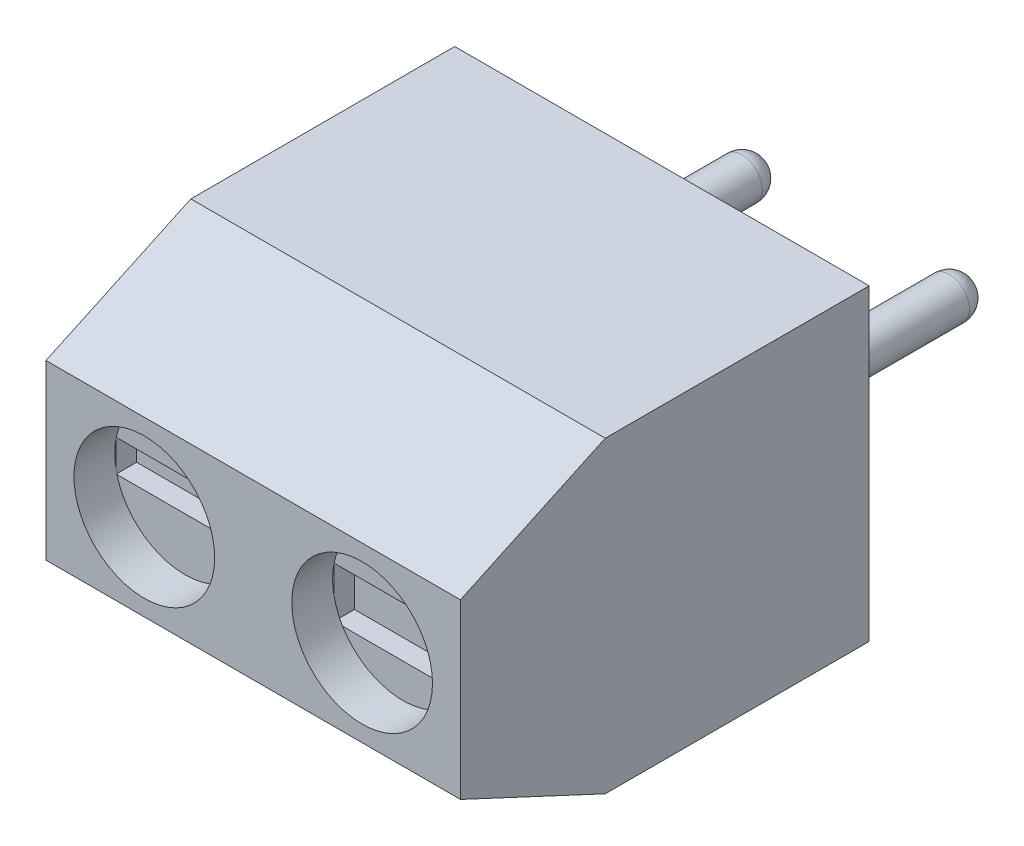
ISO-10303-21;
HEADER;
FILE_DESCRIPTION(('STEP AP214'),'2;1');
FILE_NAME('part.step','',(''),(''),'','','');
FILE_SCHEMA(('AUTOMOTIVE_DESIGN { 1 0 10303 214 1 1 1 1 }'));
ENDSEC;
DATA;
#1=APPLICATION_CONTEXT('core data for automotive mechanical design processes');
#2=APPLICATION_PROTOCOL_DEFINITION('international standard','automotive_design',2000,#1);
#3=PRODUCT_CONTEXT('',#1,'mechanical');
#4=PRODUCT('Part','Part','',(#3));
#5=PRODUCT_RELATED_PRODUCT_CATEGORY('part','',(#4));
#6=PRODUCT_DEFINITION_FORMATION('','',#4);
#7=PRODUCT_DEFINITION_CONTEXT('part definition',#1,'design');
#8=PRODUCT_DEFINITION('design','',#6,#7);
#9=PRODUCT_DEFINITION_SHAPE('','',#8);
#10=(LENGTH_UNIT() NAMED_UNIT(*) SI_UNIT(.MILLI.,.METRE.));
#11=(NAMED_UNIT(*) PLANE_ANGLE_UNIT() SI_UNIT($,.RADIAN.));
#12=(NAMED_UNIT(*) SI_UNIT($,.STERADIAN.) SOLID_ANGLE_UNIT());
#13=UNCERTAINTY_MEASURE_WITH_UNIT(LENGTH_MEASURE(1.E-05),#10,'distance_accuracy_value','');
#14=(GEOMETRIC_REPRESENTATION_CONTEXT(3) GLOBAL_UNCERTAINTY_ASSIGNED_CONTEXT((#13)) GLOBAL_UNIT_ASSIGNED_CONTEXT((#10,
#11,#12)) REPRESENTATION_CONTEXT('',''));
#15=CARTESIAN_POINT('',(0.,0.,0.));
#16=DIRECTION('',(0.,0.,1.));
#17=DIRECTION('',(1.,0.,0.));
#18=AXIS2_PLACEMENT_3D('',#15,#16,#17);
#19=CARTESIAN_POINT('',(7.53,3.2,3.23499999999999));
#20=DIRECTION('',(0.,-1.,0.));
#21=DIRECTION('',(0.,0.,-1.));
#22=AXIS2_PLACEMENT_3D('',#19,#20,#21);
#23=PLANE('',#22);
#24=DIRECTION('',(0.,0.,-1.));
#25=VECTOR('',#24,1.);
#26=CARTESIAN_POINT('',(5.93860246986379,3.2,3.75756951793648));
#27=LINE('',#26,#25);
#28=CARTESIAN_POINT('',(5.93860246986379,3.2,3.75756951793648));
#29=VERTEX_POINT('',#28);
#30=CARTESIAN_POINT('',(5.93860246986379,3.2,2.7124304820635));
#31=VERTEX_POINT('',#30);
#32=EDGE_CURVE('E257',#29,#31,#27,.T.);
#33=ORIENTED_EDGE('',*,*,#32,.F.);
#34=CARTESIAN_POINT('',(7.53,3.2,3.23499999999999));
#35=DIRECTION('',(0.,-1.,0.));
#36=DIRECTION('',(0.,0.,-1.));
#37=AXIS2_PLACEMENT_3D('',#34,#35,#36);
#38=CIRCLE('',#37,1.675);
#39=EDGE_CURVE('E418',#29,#31,#38,.T.);
#40=ORIENTED_EDGE('',*,*,#39,.T.);
#41=EDGE_LOOP('',(#33,#40));
#42=FACE_BOUND('',#41,.T.);
#43=ADVANCED_FACE('F26',(#42),#23,.T.);
#44=DIRECTION('',(1.,0.,0.));
#45=VECTOR('',#44,1.);
#46=CARTESIAN_POINT('',(5.93860246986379,3.2,2.50925898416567));
#47=LINE('',#46,#45);
#48=CARTESIAN_POINT('',(6.02038913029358,3.2,2.50925898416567));
#49=VERTEX_POINT('',#48);
#50=CARTESIAN_POINT('',(9.03961086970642,3.2,2.50925898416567));
#51=VERTEX_POINT('',#50);
#52=EDGE_CURVE('E11',#49,#51,#47,.T.);
#53=ORIENTED_EDGE('',*,*,#52,.F.);
#54=EDGE_CURVE('E413',#49,#51,#38,.T.);
#55=ORIENTED_EDGE('',*,*,#54,.T.);
#56=EDGE_LOOP('',(#53,#55));
#57=FACE_BOUND('',#56,.T.);
#58=ADVANCED_FACE('F597',(#57),#23,.T.);
#59=CARTESIAN_POINT('',(2.535,3.2,3.23499999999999));
#60=DIRECTION('',(0.,-1.,0.));
#61=DIRECTION('',(0.,0.,-1.));
#62=AXIS2_PLACEMENT_3D('',#59,#60,#61);
#63=PLANE('',#62);
#64=DIRECTION('',(0.,0.,1.));
#65=VECTOR('',#64,1.);
#66=CARTESIAN_POINT('',(4.13961086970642,3.2,3.75756951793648));
#67=LINE('',#66,#65);
#68=CARTESIAN_POINT('',(4.13961086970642,3.2,2.75453256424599));
#69=VERTEX_POINT('',#68);
#70=CARTESIAN_POINT('',(4.13961086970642,3.2,3.71546743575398));
#71=VERTEX_POINT('',#70);
#72=EDGE_CURVE('E299',#69,#71,#67,.T.);
#73=ORIENTED_EDGE('',*,*,#72,.F.);
#74=CARTESIAN_POINT('',(2.535,3.2,3.23499999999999));
#75=DIRECTION('',(0.,-1.,0.));
#76=DIRECTION('',(0.,0.,-1.));
#77=AXIS2_PLACEMENT_3D('',#74,#75,#76);
#78=CIRCLE('',#77,1.675);
#79=EDGE_CURVE('E406',#69,#71,#78,.T.);
#80=ORIENTED_EDGE('',*,*,#79,.T.);
#81=EDGE_LOOP('',(#73,#80));
#82=FACE_BOUND('',#81,.T.);
#83=ADVANCED_FACE('F578',(#82),#63,.T.);
#84=DIRECTION('',(1.,0.,0.));
#85=VECTOR('',#84,1.);
#86=CARTESIAN_POINT('',(0.943602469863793,3.2,2.75453256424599));
#87=LINE('',#86,#85);
#88=CARTESIAN_POINT('',(0.943602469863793,3.2,2.75453256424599));
#89=VERTEX_POINT('',#88);
#90=EDGE_CURVE('E295',#89,#69,#87,.T.);
#91=ORIENTED_EDGE('',*,*,#90,.F.);
#92=DIRECTION('',(0.,0.,-1.));
#93=VECTOR('',#92,1.);
#94=CARTESIAN_POINT('',(0.943602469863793,3.2,3.75756951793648));
#95=LINE('',#94,#93);
#96=CARTESIAN_POINT('',(0.943602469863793,3.2,3.75756951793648));
#97=VERTEX_POINT('',#96);
#98=EDGE_CURVE('E289',#97,#89,#95,.T.);
#99=ORIENTED_EDGE('',*,*,#98,.F.);
#100=EDGE_CURVE('E405',#97,#69,#78,.T.);
#101=ORIENTED_EDGE('',*,*,#100,.T.);
#102=EDGE_LOOP('',(#91,#99,#101));
#103=FACE_BOUND('',#102,.T.);
#104=ADVANCED_FACE('F566',(#103),#63,.T.);
#105=CARTESIAN_POINT('',(7.74987958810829,3.775,9.02));
#106=DIRECTION('',(0.,0.,1.));
#107=DIRECTION('',(1.,0.,0.));
#108=AXIS2_PLACEMENT_3D('',#105,#106,#107);
#109=PLANE('',#108);
#110=DIRECTION('',(0.,-1.,0.));
#111=VECTOR('',#110,1.);
#112=CARTESIAN_POINT('',(6.06071375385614,4.12477676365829,9.02));
#113=LINE('',#112,#111);
#114=CARTESIAN_POINT('',(6.06071375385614,4.12477676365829,9.02));
#115=VERTEX_POINT('',#114);
#116=CARTESIAN_POINT('',(6.06071375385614,3.42522323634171,9.02));
#117=VERTEX_POINT('',#116);
#118=EDGE_CURVE('E325',#115,#117,#113,.T.);
#119=ORIENTED_EDGE('',*,*,#118,.F.);
#120=CARTESIAN_POINT('',(7.74987958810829,3.775,9.02));
#121=DIRECTION('',(0.,0.,1.));
#122=DIRECTION('',(1.,0.,0.));
#123=AXIS2_PLACEMENT_3D('',#120,#121,#122);
#124=CIRCLE('',#123,1.725);
#125=EDGE_CURVE('E486',#115,#117,#124,.T.);
#126=ORIENTED_EDGE('',*,*,#125,.T.);
#127=EDGE_LOOP('',(#119,#126));
#128=FACE_BOUND('',#127,.T.);
#129=ADVANCED_FACE('F718',(#128),#109,.T.);
#130=DIRECTION('',(1.,0.,0.));
#131=VECTOR('',#130,1.);
#132=CARTESIAN_POINT('',(6.06071375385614,2.88966585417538,9.02));
#133=LINE('',#132,#131);
#134=CARTESIAN_POINT('',(6.2694038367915,2.88966585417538,9.02));
#135=VERTEX_POINT('',#134);
#136=CARTESIAN_POINT('',(9.23035533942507,2.88966585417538,9.02));
#137=VERTEX_POINT('',#136);
#138=EDGE_CURVE('E332',#135,#137,#133,.T.);
#139=ORIENTED_EDGE('',*,*,#138,.F.);
#140=EDGE_CURVE('E1037',#135,#137,#124,.T.);
#141=ORIENTED_EDGE('',*,*,#140,.T.);
#142=EDGE_LOOP('',(#139,#141));
#143=FACE_BOUND('',#142,.T.);
#144=ADVANCED_FACE('F719',(#143),#109,.T.);
#145=CARTESIAN_POINT('',(2.41012041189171,3.775,9.02));
#146=DIRECTION('',(0.,0.,1.));
#147=DIRECTION('',(1.,0.,0.));
#148=AXIS2_PLACEMENT_3D('',#145,#146,#147);
#149=PLANE('',#148);
#150=DIRECTION('',(0.,-1.,0.));
#151=VECTOR('',#150,1.);
#152=CARTESIAN_POINT('',(0.720954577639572,4.12477676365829,9.02));
#153=LINE('',#152,#151);
#154=CARTESIAN_POINT('',(0.720954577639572,4.12477676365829,9.02));
#155=VERTEX_POINT('',#154);
#156=CARTESIAN_POINT('',(0.720954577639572,3.42522323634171,9.02));
#157=VERTEX_POINT('',#156);
#158=EDGE_CURVE('E361',#155,#157,#153,.T.);
#159=ORIENTED_EDGE('',*,*,#158,.F.);
#160=CARTESIAN_POINT('',(2.41012041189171,3.775,9.02));
#161=DIRECTION('',(0.,0.,1.));
#162=DIRECTION('',(1.,0.,0.));
#163=AXIS2_PLACEMENT_3D('',#160,#161,#162);
#164=CIRCLE('',#163,1.725);
#165=EDGE_CURVE('E494',#155,#157,#164,.T.);
#166=ORIENTED_EDGE('',*,*,#165,.T.);
#167=EDGE_LOOP('',(#159,#166));
#168=FACE_BOUND('',#167,.T.);
#169=ADVANCED_FACE('F710',(#168),#149,.T.);
#170=DIRECTION('',(1.,0.,0.));
#171=VECTOR('',#170,1.);
#172=CARTESIAN_POINT('',(0.720954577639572,3.34472594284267,9.02));
#173=LINE('',#172,#171);
#174=CARTESIAN_POINT('',(0.73964466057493,3.34472594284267,9.02));
#175=VERTEX_POINT('',#174);
#176=CARTESIAN_POINT('',(4.08059616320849,3.34472594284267,9.02));
#177=VERTEX_POINT('',#176);
#178=EDGE_CURVE('E368',#175,#177,#173,.T.);
#179=ORIENTED_EDGE('',*,*,#178,.F.);
#180=EDGE_CURVE('E1057',#175,#177,#164,.T.);
#181=ORIENTED_EDGE('',*,*,#180,.T.);
#182=EDGE_LOOP('',(#179,#181));
#183=FACE_BOUND('',#182,.T.);
#184=ADVANCED_FACE('F695',(#183),#149,.T.);
#185=CARTESIAN_POINT('',(0.,0.,0.));
#186=DIRECTION('',(0.,0.,-1.));
#187=DIRECTION('',(-1.,0.,0.));
#188=AXIS2_PLACEMENT_3D('',#185,#186,#187);
#189=PLANE('',#188);
#190=CARTESIAN_POINT('',(7.62,3.775,0.));
#191=DIRECTION('',(0.,0.,-1.));
#192=DIRECTION('',(-1.,0.,0.));
#193=AXIS2_PLACEMENT_3D('',#190,#191,#192);
#194=CIRCLE('',#193,0.500000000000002);
#195=CARTESIAN_POINT('',(7.12,3.775,0.));
#196=VERTEX_POINT('',#195);
#197=EDGE_CURVE('E399',#196,#196,#194,.T.);
#198=ORIENTED_EDGE('',*,*,#197,.F.);
#199=EDGE_LOOP('',(#198));
#200=FACE_BOUND('',#199,.T.);
#201=DIRECTION('',(0.,-1.,0.));
#202=VECTOR('',#201,1.);
#203=CARTESIAN_POINT('',(0.,0.,0.));
#204=LINE('',#203,#202);
#205=CARTESIAN_POINT('',(0.,7.55,0.));
#206=VERTEX_POINT('',#205);
#207=CARTESIAN_POINT('',(0.,0.,0.));
#208=VERTEX_POINT('',#207);
#209=EDGE_CURVE('E497',#206,#208,#204,.T.);
#210=ORIENTED_EDGE('',*,*,#209,.F.);
#211=DIRECTION('',(-1.,0.,0.));
#212=VECTOR('',#211,1.);
#213=CARTESIAN_POINT('',(0.,7.55,0.));
#214=LINE('',#213,#212);
#215=CARTESIAN_POINT('',(10.16,7.55,0.));
#216=VERTEX_POINT('',#215);
#217=EDGE_CURVE('E507',#216,#206,#214,.T.);
#218=ORIENTED_EDGE('',*,*,#217,.F.);
#219=DIRECTION('',(0.,1.,0.));
#220=VECTOR('',#219,1.);
#221=CARTESIAN_POINT('',(10.16,0.,0.));
#222=LINE('',#221,#220);
#223=CARTESIAN_POINT('',(10.16,0.,0.));
#224=VERTEX_POINT('',#223);
#225=EDGE_CURVE('E504',#224,#216,#222,.T.);
#226=ORIENTED_EDGE('',*,*,#225,.F.);
#227=DIRECTION('',(1.,0.,0.));
#228=VECTOR('',#227,1.);
#229=CARTESIAN_POINT('',(0.,0.,0.));
#230=LINE('',#229,#228);
#231=EDGE_CURVE('E501',#208,#224,#230,.T.);
#232=ORIENTED_EDGE('',*,*,#231,.F.);
#233=EDGE_LOOP('',(#210,#218,#226,#232));
#234=FACE_BOUND('',#233,.T.);
#235=CARTESIAN_POINT('',(2.54,3.775,0.));
#236=DIRECTION('',(0.,0.,-1.));
#237=DIRECTION('',(-1.,0.,0.));
#238=AXIS2_PLACEMENT_3D('',#235,#236,#237);
#239=CIRCLE('',#238,0.5);
#240=CARTESIAN_POINT('',(2.04,3.775,0.));
#241=VERTEX_POINT('',#240);
#242=EDGE_CURVE('E388',#241,#241,#239,.T.);
#243=ORIENTED_EDGE('',*,*,#242,.F.);
#244=EDGE_LOOP('',(#243));
#245=FACE_BOUND('',#244,.T.);
#246=ADVANCED_FACE('F680',(#200,#234,#245),#189,.T.);
#247=CARTESIAN_POINT('',(0.,0.,10.02));
#248=DIRECTION('',(1.,0.,0.));
#249=DIRECTION('',(0.,0.,-1.));
#250=AXIS2_PLACEMENT_3D('',#247,#248,#249);
#251=PLANE('',#250);
#252=DIRECTION('',(0.,-1.,0.));
#253=VECTOR('',#252,1.);
#254=CARTESIAN_POINT('',(0.,0.,10.02));
#255=LINE('',#254,#253);
#256=CARTESIAN_POINT('',(0.,5.89460781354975,10.02));
#257=VERTEX_POINT('',#256);
#258=CARTESIAN_POINT('',(0.,1.65539218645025,10.02));
#259=VERTEX_POINT('',#258);
#260=EDGE_CURVE('E510',#257,#259,#255,.T.);
#261=ORIENTED_EDGE('',*,*,#260,.F.);
#262=DIRECTION('',(0.,-0.422618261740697,0.906307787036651));
#263=VECTOR('',#262,1.);
#264=CARTESIAN_POINT('',(0.,5.89460781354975,10.02));
#265=LINE('',#264,#263);
#266=CARTESIAN_POINT('',(0.,7.55,6.46999999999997));
#267=VERTEX_POINT('',#266);
#268=EDGE_CURVE('E532',#257,#267,#265,.F.);
#269=ORIENTED_EDGE('',*,*,#268,.T.);
#270=DIRECTION('',(0.,0.,-1.));
#271=VECTOR('',#270,1.);
#272=CARTESIAN_POINT('',(0.,7.55,10.02));
#273=LINE('',#272,#271);
#274=EDGE_CURVE('E516',#267,#206,#273,.T.);
#275=ORIENTED_EDGE('',*,*,#274,.T.);
#276=ORIENTED_EDGE('',*,*,#209,.T.);
#277=DIRECTION('',(0.,0.,-1.));
#278=VECTOR('',#277,1.);
#279=CARTESIAN_POINT('',(0.,0.,10.02));
#280=LINE('',#279,#278);
#281=CARTESIAN_POINT('',(0.,0.,6.46999999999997));
#282=VERTEX_POINT('',#281);
#283=EDGE_CURVE('E522',#282,#208,#280,.T.);
#284=ORIENTED_EDGE('',*,*,#283,.F.);
#285=DIRECTION('',(0.,-0.422618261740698,-0.906307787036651));
#286=VECTOR('',#285,1.);
#287=CARTESIAN_POINT('',(0.,1.65539218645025,10.02));
#288=LINE('',#287,#286);
#289=EDGE_CURVE('E530',#282,#259,#288,.F.);
#290=ORIENTED_EDGE('',*,*,#289,.T.);
#291=EDGE_LOOP('',(#261,#269,#275,#276,#284,#290));
#292=FACE_BOUND('',#291,.T.);
#293=ADVANCED_FACE('F28',(#292),#251,.F.);
#294=CARTESIAN_POINT('',(0.,0.,10.02));
#295=DIRECTION('',(0.,1.,0.));
#296=DIRECTION('',(0.,0.,1.));
#297=AXIS2_PLACEMENT_3D('',#294,#295,#296);
#298=PLANE('',#297);
#299=DIRECTION('',(-1.,0.,0.));
#300=VECTOR('',#299,1.);
#301=CARTESIAN_POINT('',(4.63,0.,5.8));
#302=LINE('',#301,#300);
#303=CARTESIAN_POINT('',(4.63,0.,5.8));
#304=VERTEX_POINT('',#303);
#305=CARTESIAN_POINT('',(0.629999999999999,0.,5.8));
#306=VERTEX_POINT('',#305);
#307=EDGE_CURVE('E420',#304,#306,#302,.T.);
#308=ORIENTED_EDGE('',*,*,#307,.F.);
#309=DIRECTION('',(0.,0.,1.));
#310=VECTOR('',#309,1.);
#311=CARTESIAN_POINT('',(4.63,0.,5.8));
#312=LINE('',#311,#310);
#313=CARTESIAN_POINT('',(4.63,0.,0.800000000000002));
#314=VERTEX_POINT('',#313);
#315=EDGE_CURVE('E417',#314,#304,#312,.T.);
#316=ORIENTED_EDGE('',*,*,#315,.F.);
#317=DIRECTION('',(1.,0.,0.));
#318=VECTOR('',#317,1.);
#319=CARTESIAN_POINT('',(4.63,0.,0.800000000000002));
#320=LINE('',#319,#318);
#321=CARTESIAN_POINT('',(0.63,0.,0.800000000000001));
#322=VERTEX_POINT('',#321);
#323=EDGE_CURVE('E426',#322,#314,#320,.T.);
#324=ORIENTED_EDGE('',*,*,#323,.F.);
#325=DIRECTION('',(0.,0.,-1.));
#326=VECTOR('',#325,1.);
#327=CARTESIAN_POINT('',(0.629999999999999,0.,5.8));
#328=LINE('',#327,#326);
#329=EDGE_CURVE('E423',#306,#322,#328,.T.);
#330=ORIENTED_EDGE('',*,*,#329,.F.);
#331=EDGE_LOOP('',(#308,#316,#324,#330));
#332=FACE_BOUND('',#331,.T.);
#333=DIRECTION('',(-1.,0.,0.));
#334=VECTOR('',#333,1.);
#335=CARTESIAN_POINT('',(9.53,0.,5.8));
#336=LINE('',#335,#334);
#337=CARTESIAN_POINT('',(9.53,0.,5.8));
#338=VERTEX_POINT('',#337);
#339=CARTESIAN_POINT('',(5.53,0.,5.8));
#340=VERTEX_POINT('',#339);
#341=EDGE_CURVE('E452',#338,#340,#336,.T.);
#342=ORIENTED_EDGE('',*,*,#341,.F.);
#343=DIRECTION('',(0.,0.,1.));
#344=VECTOR('',#343,1.);
#345=CARTESIAN_POINT('',(9.53,0.,5.8));
#346=LINE('',#345,#344);
#347=CARTESIAN_POINT('',(9.53,0.,0.800000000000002));
#348=VERTEX_POINT('',#347);
#349=EDGE_CURVE('E444',#348,#338,#346,.T.);
#350=ORIENTED_EDGE('',*,*,#349,.F.);
#351=DIRECTION('',(1.,0.,0.));
#352=VECTOR('',#351,1.);
#353=CARTESIAN_POINT('',(9.53,0.,0.800000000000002));
#354=LINE('',#353,#352);
#355=CARTESIAN_POINT('',(5.53,0.,0.800000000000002));
#356=VERTEX_POINT('',#355);
#357=EDGE_CURVE('E458',#356,#348,#354,.T.);
#358=ORIENTED_EDGE('',*,*,#357,.F.);
#359=DIRECTION('',(0.,0.,-1.));
#360=VECTOR('',#359,1.);
#361=CARTESIAN_POINT('',(5.53,0.,5.8));
#362=LINE('',#361,#360);
#363=EDGE_CURVE('E455',#340,#356,#362,.T.);
#364=ORIENTED_EDGE('',*,*,#363,.F.);
#365=EDGE_LOOP('',(#342,#350,#358,#364));
#366=FACE_BOUND('',#365,.T.);
#367=DIRECTION('',(0.,0.,-1.));
#368=VECTOR('',#367,1.);
#369=CARTESIAN_POINT('',(10.16,0.,10.02));
#370=LINE('',#369,#368);
#371=CARTESIAN_POINT('',(10.16,0.,6.46999999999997));
#372=VERTEX_POINT('',#371);
#373=EDGE_CURVE('E520',#372,#224,#370,.T.);
#374=ORIENTED_EDGE('',*,*,#373,.F.);
#375=DIRECTION('',(-1.,0.,0.));
#376=VECTOR('',#375,1.);
#377=CARTESIAN_POINT('',(0.,0.,6.46999999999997));
#378=LINE('',#377,#376);
#379=EDGE_CURVE('E540',#372,#282,#378,.T.);
#380=ORIENTED_EDGE('',*,*,#379,.T.);
#381=ORIENTED_EDGE('',*,*,#283,.T.);
#382=ORIENTED_EDGE('',*,*,#231,.T.);
#383=EDGE_LOOP('',(#374,#380,#381,#382));
#384=FACE_BOUND('',#383,.T.);
#385=ADVANCED_FACE('F648',(#332,#366,#384),#298,.F.);
#386=CARTESIAN_POINT('',(10.16,0.,10.02));
#387=DIRECTION('',(-1.,0.,0.));
#388=DIRECTION('',(0.,0.,1.));
#389=AXIS2_PLACEMENT_3D('',#386,#387,#388);
#390=PLANE('',#389);
#391=DIRECTION('',(0.,0.,-1.));
#392=VECTOR('',#391,1.);
#393=CARTESIAN_POINT('',(10.16,7.55,10.02));
#394=LINE('',#393,#392);
#395=CARTESIAN_POINT('',(10.16,7.55,6.46999999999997));
#396=VERTEX_POINT('',#395);
#397=EDGE_CURVE('E518',#396,#216,#394,.T.);
#398=ORIENTED_EDGE('',*,*,#397,.F.);
#399=DIRECTION('',(0.,0.422618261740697,-0.906307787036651));
#400=VECTOR('',#399,1.);
#401=CARTESIAN_POINT('',(10.16,5.89460781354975,10.02));
#402=LINE('',#401,#400);
#403=CARTESIAN_POINT('',(10.16,5.89460781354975,10.02));
#404=VERTEX_POINT('',#403);
#405=EDGE_CURVE('E538',#396,#404,#402,.F.);
#406=ORIENTED_EDGE('',*,*,#405,.T.);
#407=DIRECTION('',(0.,1.,0.));
#408=VECTOR('',#407,1.);
#409=CARTESIAN_POINT('',(10.16,0.,10.02));
#410=LINE('',#409,#408);
#411=CARTESIAN_POINT('',(10.16,1.65539218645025,10.02));
#412=VERTEX_POINT('',#411);
#413=EDGE_CURVE('E513',#412,#404,#410,.T.);
#414=ORIENTED_EDGE('',*,*,#413,.F.);
#415=DIRECTION('',(0.,0.422618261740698,0.906307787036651));
#416=VECTOR('',#415,1.);
#417=CARTESIAN_POINT('',(10.16,1.65539218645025,10.02));
#418=LINE('',#417,#416);
#419=EDGE_CURVE('E536',#412,#372,#418,.F.);
#420=ORIENTED_EDGE('',*,*,#419,.T.);
#421=ORIENTED_EDGE('',*,*,#373,.T.);
#422=ORIENTED_EDGE('',*,*,#225,.T.);
#423=EDGE_LOOP('',(#398,#406,#414,#420,#421,#422));
#424=FACE_BOUND('',#423,.T.);
#425=ADVANCED_FACE('F651',(#424),#390,.F.);
#426=CARTESIAN_POINT('',(0.,7.55,10.02));
#427=DIRECTION('',(0.,-1.,0.));
#428=DIRECTION('',(1.,0.,0.));
#429=AXIS2_PLACEMENT_3D('',#426,#427,#428);
#430=PLANE('',#429);
#431=ORIENTED_EDGE('',*,*,#274,.F.);
#432=DIRECTION('',(1.,0.,0.));
#433=VECTOR('',#432,1.);
#434=CARTESIAN_POINT('',(0.,7.55,6.46999999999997));
#435=LINE('',#434,#433);
#436=EDGE_CURVE('E534',#267,#396,#435,.T.);
#437=ORIENTED_EDGE('',*,*,#436,.T.);
#438=ORIENTED_EDGE('',*,*,#397,.T.);
#439=ORIENTED_EDGE('',*,*,#217,.T.);
#440=EDGE_LOOP('',(#431,#437,#438,#439));
#441=FACE_BOUND('',#440,.T.);
#442=ADVANCED_FACE('F675',(#441),#430,.F.);
#443=CARTESIAN_POINT('',(0.,0.,10.02));
#444=DIRECTION('',(0.,0.,-1.));
#445=DIRECTION('',(-1.,0.,0.));
#446=AXIS2_PLACEMENT_3D('',#443,#444,#445);
#447=PLANE('',#446);
#448=CARTESIAN_POINT('',(7.74987958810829,3.775,10.02));
#449=DIRECTION('',(0.,0.,1.));
#450=DIRECTION('',(1.,0.,0.));
#451=AXIS2_PLACEMENT_3D('',#448,#449,#450);
#452=CIRCLE('',#451,1.725);
#453=CARTESIAN_POINT('',(9.47487958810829,3.775,10.02));
#454=VERTEX_POINT('',#453);
#455=EDGE_CURVE('E476',#454,#454,#452,.T.);
#456=ORIENTED_EDGE('',*,*,#455,.F.);
#457=EDGE_LOOP('',(#456));
#458=FACE_BOUND('',#457,.T.);
#459=CARTESIAN_POINT('',(2.41012041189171,3.775,10.02));
#460=DIRECTION('',(0.,0.,1.));
#461=DIRECTION('',(1.,0.,0.));
#462=AXIS2_PLACEMENT_3D('',#459,#460,#461);
#463=CIRCLE('',#462,1.725);
#464=CARTESIAN_POINT('',(4.13512041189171,3.775,10.02));
#465=VERTEX_POINT('',#464);
#466=EDGE_CURVE('E489',#465,#465,#463,.T.);
#467=ORIENTED_EDGE('',*,*,#466,.F.);
#468=EDGE_LOOP('',(#467));
#469=FACE_BOUND('',#468,.T.);
#470=ORIENTED_EDGE('',*,*,#413,.T.);
#471=DIRECTION('',(-1.,0.,0.));
#472=VECTOR('',#471,1.);
#473=CARTESIAN_POINT('',(0.,5.89460781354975,10.02));
#474=LINE('',#473,#472);
#475=EDGE_CURVE('E527',#404,#257,#474,.T.);
#476=ORIENTED_EDGE('',*,*,#475,.T.);
#477=ORIENTED_EDGE('',*,*,#260,.T.);
#478=DIRECTION('',(1.,0.,0.));
#479=VECTOR('',#478,1.);
#480=CARTESIAN_POINT('',(0.,1.65539218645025,10.02));
#481=LINE('',#480,#479);
#482=EDGE_CURVE('E524',#259,#412,#481,.T.);
#483=ORIENTED_EDGE('',*,*,#482,.T.);
#484=EDGE_LOOP('',(#470,#476,#477,#483));
#485=FACE_BOUND('',#484,.T.);
#486=ADVANCED_FACE('F666',(#458,#469,#485),#447,.F.);
#487=CARTESIAN_POINT('',(0.,5.89460781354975,10.02));
#488=DIRECTION('',(0.,-0.906307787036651,-0.422618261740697));
#489=DIRECTION('',(0.,0.422618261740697,-0.906307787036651));
#490=AXIS2_PLACEMENT_3D('',#487,#488,#489);
#491=PLANE('',#490);
#492=ORIENTED_EDGE('',*,*,#405,.F.);
#493=ORIENTED_EDGE('',*,*,#436,.F.);
#494=ORIENTED_EDGE('',*,*,#268,.F.);
#495=ORIENTED_EDGE('',*,*,#475,.F.);
#496=EDGE_LOOP('',(#492,#493,#494,#495));
#497=FACE_BOUND('',#496,.T.);
#498=ADVANCED_FACE('F671',(#497),#491,.F.);
#499=CARTESIAN_POINT('',(0.,1.65539218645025,10.02));
#500=DIRECTION('',(0.,0.906307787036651,-0.422618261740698));
#501=DIRECTION('',(0.,0.422618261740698,0.906307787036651));
#502=AXIS2_PLACEMENT_3D('',#499,#500,#501);
#503=PLANE('',#502);
#504=ORIENTED_EDGE('',*,*,#289,.F.);
#505=ORIENTED_EDGE('',*,*,#379,.F.);
#506=ORIENTED_EDGE('',*,*,#419,.F.);
#507=ORIENTED_EDGE('',*,*,#482,.F.);
#508=EDGE_LOOP('',(#504,#505,#506,#507));
#509=FACE_BOUND('',#508,.T.);
#510=ADVANCED_FACE('F661',(#509),#503,.F.);
#511=CARTESIAN_POINT('',(2.41012041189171,3.775,9.02));
#512=DIRECTION('',(0.,0.,1.));
#513=DIRECTION('',(1.,0.,0.));
#514=AXIS2_PLACEMENT_3D('',#511,#512,#513);
#515=CYLINDRICAL_SURFACE('',#514,1.725);
#516=ORIENTED_EDGE('',*,*,#165,.F.);
#517=EDGE_CURVE('E493',#177,#155,#164,.T.);
#518=ORIENTED_EDGE('',*,*,#517,.F.);
#519=ORIENTED_EDGE('',*,*,#180,.F.);
#520=EDGE_CURVE('E498',#157,#175,#164,.T.);
#521=ORIENTED_EDGE('',*,*,#520,.F.);
#522=EDGE_LOOP('',(#516,#518,#519,#521));
#523=FACE_BOUND('',#522,.T.);
#524=ORIENTED_EDGE('',*,*,#466,.T.);
#525=EDGE_LOOP('',(#524));
#526=FACE_BOUND('',#525,.T.);
#527=ADVANCED_FACE('F701',(#523,#526),#515,.F.);
#528=DIRECTION('',(0.,1.,0.));
#529=VECTOR('',#528,1.);
#530=CARTESIAN_POINT('',(4.08059616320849,4.12477676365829,9.02));
#531=LINE('',#530,#529);
#532=CARTESIAN_POINT('',(4.08059616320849,4.12477676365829,9.02));
#533=VERTEX_POINT('',#532);
#534=EDGE_CURVE('E367',#177,#533,#531,.T.);
#535=ORIENTED_EDGE('',*,*,#534,.F.);
#536=ORIENTED_EDGE('',*,*,#517,.T.);
#537=DIRECTION('',(-1.,0.,0.));
#538=VECTOR('',#537,1.);
#539=CARTESIAN_POINT('',(0.720954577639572,4.12477676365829,9.02));
#540=LINE('',#539,#538);
#541=EDGE_CURVE('E370',#533,#155,#540,.T.);
#542=ORIENTED_EDGE('',*,*,#541,.F.);
#543=EDGE_LOOP('',(#535,#536,#542));
#544=FACE_BOUND('',#543,.T.);
#545=ADVANCED_FACE('F704',(#544),#149,.T.);
#546=CARTESIAN_POINT('',(7.74987958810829,3.775,9.02));
#547=DIRECTION('',(0.,0.,1.));
#548=DIRECTION('',(1.,0.,0.));
#549=AXIS2_PLACEMENT_3D('',#546,#547,#548);
#550=CYLINDRICAL_SURFACE('',#549,1.725);
#551=ORIENTED_EDGE('',*,*,#125,.F.);
#552=EDGE_CURVE('E485',#137,#115,#124,.T.);
#553=ORIENTED_EDGE('',*,*,#552,.F.);
#554=ORIENTED_EDGE('',*,*,#140,.F.);
#555=EDGE_CURVE('E490',#117,#135,#124,.T.);
#556=ORIENTED_EDGE('',*,*,#555,.F.);
#557=EDGE_LOOP('',(#551,#553,#554,#556));
#558=FACE_BOUND('',#557,.T.);
#559=ORIENTED_EDGE('',*,*,#455,.T.);
#560=EDGE_LOOP('',(#559));
#561=FACE_BOUND('',#560,.T.);
#562=ADVANCED_FACE('F708',(#558,#561),#550,.F.);
#563=DIRECTION('',(0.,1.,0.));
#564=VECTOR('',#563,1.);
#565=CARTESIAN_POINT('',(9.23035533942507,4.12477676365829,9.02));
#566=LINE('',#565,#564);
#567=CARTESIAN_POINT('',(9.23035533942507,4.12477676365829,9.02));
#568=VERTEX_POINT('',#567);
#569=EDGE_CURVE('E331',#137,#568,#566,.T.);
#570=ORIENTED_EDGE('',*,*,#569,.F.);
#571=ORIENTED_EDGE('',*,*,#552,.T.);
#572=DIRECTION('',(-1.,0.,0.));
#573=VECTOR('',#572,1.);
#574=CARTESIAN_POINT('',(6.06071375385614,4.12477676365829,9.02));
#575=LINE('',#574,#573);
#576=EDGE_CURVE('E334',#568,#115,#575,.T.);
#577=ORIENTED_EDGE('',*,*,#576,.F.);
#578=EDGE_LOOP('',(#570,#571,#577));
#579=FACE_BOUND('',#578,.T.);
#580=ADVANCED_FACE('F713',(#579),#109,.T.);
#581=CARTESIAN_POINT('',(9.53,1.6,5.8));
#582=DIRECTION('',(1.,0.,0.));
#583=DIRECTION('',(0.,0.,-1.));
#584=AXIS2_PLACEMENT_3D('',#581,#582,#583);
#585=PLANE('',#584);
#586=ORIENTED_EDGE('',*,*,#349,.T.);
#587=DIRECTION('',(0.,-1.,0.));
#588=VECTOR('',#587,1.);
#589=CARTESIAN_POINT('',(9.53,1.6,5.8));
#590=LINE('',#589,#588);
#591=CARTESIAN_POINT('',(9.53,1.6,5.8));
#592=VERTEX_POINT('',#591);
#593=EDGE_CURVE('E473',#592,#338,#590,.T.);
#594=ORIENTED_EDGE('',*,*,#593,.F.);
#595=DIRECTION('',(0.,0.,1.));
#596=VECTOR('',#595,1.);
#597=CARTESIAN_POINT('',(9.53,1.6,5.8));
#598=LINE('',#597,#596);
#599=CARTESIAN_POINT('',(9.53,1.6,0.800000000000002));
#600=VERTEX_POINT('',#599);
#601=EDGE_CURVE('E461',#600,#592,#598,.T.);
#602=ORIENTED_EDGE('',*,*,#601,.F.);
#603=DIRECTION('',(0.,-1.,0.));
#604=VECTOR('',#603,1.);
#605=CARTESIAN_POINT('',(9.53,1.6,0.800000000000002));
#606=LINE('',#605,#604);
#607=EDGE_CURVE('E474',#600,#348,#606,.T.);
#608=ORIENTED_EDGE('',*,*,#607,.T.);
#609=EDGE_LOOP('',(#586,#594,#602,#608));
#610=FACE_BOUND('',#609,.T.);
#611=ADVANCED_FACE('F636',(#610),#585,.F.);
#612=CARTESIAN_POINT('',(9.53,1.6,0.800000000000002));
#613=DIRECTION('',(0.,0.,-1.));
#614=DIRECTION('',(-1.,0.,0.));
#615=AXIS2_PLACEMENT_3D('',#612,#613,#614);
#616=PLANE('',#615);
#617=ORIENTED_EDGE('',*,*,#357,.T.);
#618=ORIENTED_EDGE('',*,*,#607,.F.);
#619=DIRECTION('',(1.,0.,0.));
#620=VECTOR('',#619,1.);
#621=CARTESIAN_POINT('',(9.53,1.6,0.800000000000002));
#622=LINE('',#621,#620);
#623=CARTESIAN_POINT('',(5.53,1.6,0.800000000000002));
#624=VERTEX_POINT('',#623);
#625=EDGE_CURVE('E470',#624,#600,#622,.T.);
#626=ORIENTED_EDGE('',*,*,#625,.F.);
#627=DIRECTION('',(0.,-1.,0.));
#628=VECTOR('',#627,1.);
#629=CARTESIAN_POINT('',(5.53,1.6,0.800000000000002));
#630=LINE('',#629,#628);
#631=EDGE_CURVE('E477',#624,#356,#630,.T.);
#632=ORIENTED_EDGE('',*,*,#631,.T.);
#633=EDGE_LOOP('',(#617,#618,#626,#632));
#634=FACE_BOUND('',#633,.T.);
#635=ADVANCED_FACE('F645',(#634),#616,.F.);
#636=CARTESIAN_POINT('',(5.53,1.6,5.8));
#637=DIRECTION('',(-1.,0.,0.));
#638=DIRECTION('',(0.,0.,1.));
#639=AXIS2_PLACEMENT_3D('',#636,#637,#638);
#640=PLANE('',#639);
#641=ORIENTED_EDGE('',*,*,#363,.T.);
#642=ORIENTED_EDGE('',*,*,#631,.F.);
#643=DIRECTION('',(0.,0.,-1.));
#644=VECTOR('',#643,1.);
#645=CARTESIAN_POINT('',(5.53,1.6,5.8));
#646=LINE('',#645,#644);
#647=CARTESIAN_POINT('',(5.53,1.6,5.8));
#648=VERTEX_POINT('',#647);
#649=EDGE_CURVE('E467',#648,#624,#646,.T.);
#650=ORIENTED_EDGE('',*,*,#649,.F.);
#651=DIRECTION('',(0.,-1.,0.));
#652=VECTOR('',#651,1.);
#653=CARTESIAN_POINT('',(5.53,1.6,5.8));
#654=LINE('',#653,#652);
#655=EDGE_CURVE('E479',#648,#340,#654,.T.);
#656=ORIENTED_EDGE('',*,*,#655,.T.);
#657=EDGE_LOOP('',(#641,#642,#650,#656));
#658=FACE_BOUND('',#657,.T.);
#659=ADVANCED_FACE('F643',(#658),#640,.F.);
#660=CARTESIAN_POINT('',(9.53,1.6,5.8));
#661=DIRECTION('',(0.,0.,1.));
#662=DIRECTION('',(1.,0.,0.));
#663=AXIS2_PLACEMENT_3D('',#660,#661,#662);
#664=PLANE('',#663);
#665=ORIENTED_EDGE('',*,*,#341,.T.);
#666=ORIENTED_EDGE('',*,*,#655,.F.);
#667=DIRECTION('',(-1.,0.,0.));
#668=VECTOR('',#667,1.);
#669=CARTESIAN_POINT('',(9.53,1.6,5.8));
#670=LINE('',#669,#668);
#671=EDGE_CURVE('E464',#592,#648,#670,.T.);
#672=ORIENTED_EDGE('',*,*,#671,.F.);
#673=ORIENTED_EDGE('',*,*,#593,.T.);
#674=EDGE_LOOP('',(#665,#666,#672,#673));
#675=FACE_BOUND('',#674,.T.);
#676=ADVANCED_FACE('F630',(#675),#664,.F.);
#677=CARTESIAN_POINT('',(9.53,1.6,5.8));
#678=DIRECTION('',(0.,1.,0.));
#679=DIRECTION('',(0.,0.,1.));
#680=AXIS2_PLACEMENT_3D('',#677,#678,#679);
#681=PLANE('',#680);
#682=CARTESIAN_POINT('',(7.53,1.6,3.23499999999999));
#683=DIRECTION('',(0.,-1.,0.));
#684=DIRECTION('',(0.,0.,-1.));
#685=AXIS2_PLACEMENT_3D('',#682,#683,#684);
#686=CIRCLE('',#685,1.675);
#687=CARTESIAN_POINT('',(7.53,1.6,1.55999999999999));
#688=VERTEX_POINT('',#687);
#689=EDGE_CURVE('E409',#688,#688,#686,.T.);
#690=ORIENTED_EDGE('',*,*,#689,.F.);
#691=EDGE_LOOP('',(#690));
#692=FACE_BOUND('',#691,.T.);
#693=ORIENTED_EDGE('',*,*,#601,.T.);
#694=ORIENTED_EDGE('',*,*,#671,.T.);
#695=ORIENTED_EDGE('',*,*,#649,.T.);
#696=ORIENTED_EDGE('',*,*,#625,.T.);
#697=EDGE_LOOP('',(#693,#694,#695,#696));
#698=FACE_BOUND('',#697,.T.);
#699=ADVANCED_FACE('F626',(#692,#698),#681,.F.);
#700=CARTESIAN_POINT('',(4.63,1.6,5.8));
#701=DIRECTION('',(1.,0.,0.));
#702=DIRECTION('',(0.,0.,-1.));
#703=AXIS2_PLACEMENT_3D('',#700,#701,#702);
#704=PLANE('',#703);
#705=ORIENTED_EDGE('',*,*,#315,.T.);
#706=DIRECTION('',(0.,-1.,0.));
#707=VECTOR('',#706,1.);
#708=CARTESIAN_POINT('',(4.63,1.6,5.8));
#709=LINE('',#708,#707);
#710=CARTESIAN_POINT('',(4.63,1.6,5.8));
#711=VERTEX_POINT('',#710);
#712=EDGE_CURVE('E441',#711,#304,#709,.T.);
#713=ORIENTED_EDGE('',*,*,#712,.F.);
#714=DIRECTION('',(0.,0.,1.));
#715=VECTOR('',#714,1.);
#716=CARTESIAN_POINT('',(4.63,1.6,5.8));
#717=LINE('',#716,#715);
#718=CARTESIAN_POINT('',(4.63,1.6,0.800000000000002));
#719=VERTEX_POINT('',#718);
#720=EDGE_CURVE('E429',#719,#711,#717,.T.);
#721=ORIENTED_EDGE('',*,*,#720,.F.);
#722=DIRECTION('',(0.,-1.,0.));
#723=VECTOR('',#722,1.);
#724=CARTESIAN_POINT('',(4.63,1.6,0.800000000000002));
#725=LINE('',#724,#723);
#726=EDGE_CURVE('E442',#719,#314,#725,.T.);
#727=ORIENTED_EDGE('',*,*,#726,.T.);
#728=EDGE_LOOP('',(#705,#713,#721,#727));
#729=FACE_BOUND('',#728,.T.);
#730=ADVANCED_FACE('F629',(#729),#704,.F.);
#731=CARTESIAN_POINT('',(4.63,1.6,0.800000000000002));
#732=DIRECTION('',(0.,0.,-1.));
#733=DIRECTION('',(-1.,0.,0.));
#734=AXIS2_PLACEMENT_3D('',#731,#732,#733);
#735=PLANE('',#734);
#736=ORIENTED_EDGE('',*,*,#323,.T.);
#737=ORIENTED_EDGE('',*,*,#726,.F.);
#738=DIRECTION('',(1.,0.,0.));
#739=VECTOR('',#738,1.);
#740=CARTESIAN_POINT('',(4.63,1.6,0.800000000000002));
#741=LINE('',#740,#739);
#742=CARTESIAN_POINT('',(0.63,1.6,0.800000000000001));
#743=VERTEX_POINT('',#742);
#744=EDGE_CURVE('E438',#743,#719,#741,.T.);
#745=ORIENTED_EDGE('',*,*,#744,.F.);
#746=DIRECTION('',(0.,-1.,0.));
#747=VECTOR('',#746,1.);
#748=CARTESIAN_POINT('',(0.63,1.6,0.800000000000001));
#749=LINE('',#748,#747);
#750=EDGE_CURVE('E445',#743,#322,#749,.T.);
#751=ORIENTED_EDGE('',*,*,#750,.T.);
#752=EDGE_LOOP('',(#736,#737,#745,#751));
#753=FACE_BOUND('',#752,.T.);
#754=ADVANCED_FACE('F730',(#753),#735,.F.);
#755=CARTESIAN_POINT('',(0.629999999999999,1.6,5.8));
#756=DIRECTION('',(-1.,0.,0.));
#757=DIRECTION('',(0.,0.,1.));
#758=AXIS2_PLACEMENT_3D('',#755,#756,#757);
#759=PLANE('',#758);
#760=ORIENTED_EDGE('',*,*,#329,.T.);
#761=ORIENTED_EDGE('',*,*,#750,.F.);
#762=DIRECTION('',(0.,0.,-1.));
#763=VECTOR('',#762,1.);
#764=CARTESIAN_POINT('',(0.629999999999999,1.6,5.8));
#765=LINE('',#764,#763);
#766=CARTESIAN_POINT('',(0.629999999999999,1.6,5.8));
#767=VERTEX_POINT('',#766);
#768=EDGE_CURVE('E435',#767,#743,#765,.T.);
#769=ORIENTED_EDGE('',*,*,#768,.F.);
#770=DIRECTION('',(0.,-1.,0.));
#771=VECTOR('',#770,1.);
#772=CARTESIAN_POINT('',(0.629999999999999,1.6,5.8));
#773=LINE('',#772,#771);
#774=EDGE_CURVE('E447',#767,#306,#773,.T.);
#775=ORIENTED_EDGE('',*,*,#774,.T.);
#776=EDGE_LOOP('',(#760,#761,#769,#775));
#777=FACE_BOUND('',#776,.T.);
#778=ADVANCED_FACE('F735',(#777),#759,.F.);
#779=CARTESIAN_POINT('',(4.63,1.6,5.8));
#780=DIRECTION('',(0.,0.,1.));
#781=DIRECTION('',(1.,0.,0.));
#782=AXIS2_PLACEMENT_3D('',#779,#780,#781);
#783=PLANE('',#782);
#784=ORIENTED_EDGE('',*,*,#307,.T.);
#785=ORIENTED_EDGE('',*,*,#774,.F.);
#786=DIRECTION('',(-1.,0.,0.));
#787=VECTOR('',#786,1.);
#788=CARTESIAN_POINT('',(4.63,1.6,5.8));
#789=LINE('',#788,#787);
#790=EDGE_CURVE('E432',#711,#767,#789,.T.);
#791=ORIENTED_EDGE('',*,*,#790,.F.);
#792=ORIENTED_EDGE('',*,*,#712,.T.);
#793=EDGE_LOOP('',(#784,#785,#791,#792));
#794=FACE_BOUND('',#793,.T.);
#795=ADVANCED_FACE('F732',(#794),#783,.F.);
#796=CARTESIAN_POINT('',(4.63,1.6,0.800000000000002));
#797=DIRECTION('',(0.,1.,0.));
#798=DIRECTION('',(0.,0.,1.));
#799=AXIS2_PLACEMENT_3D('',#796,#797,#798);
#800=PLANE('',#799);
#801=CARTESIAN_POINT('',(2.535,1.6,3.23499999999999));
#802=DIRECTION('',(0.,-1.,0.));
#803=DIRECTION('',(0.,0.,-1.));
#804=AXIS2_PLACEMENT_3D('',#801,#802,#803);
#805=CIRCLE('',#804,1.675);
#806=CARTESIAN_POINT('',(2.535,1.6,1.55999999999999));
#807=VERTEX_POINT('',#806);
#808=EDGE_CURVE('E402',#807,#807,#805,.T.);
#809=ORIENTED_EDGE('',*,*,#808,.F.);
#810=EDGE_LOOP('',(#809));
#811=FACE_BOUND('',#810,.T.);
#812=ORIENTED_EDGE('',*,*,#720,.T.);
#813=ORIENTED_EDGE('',*,*,#790,.T.);
#814=ORIENTED_EDGE('',*,*,#768,.T.);
#815=ORIENTED_EDGE('',*,*,#744,.T.);
#816=EDGE_LOOP('',(#812,#813,#814,#815));
#817=FACE_BOUND('',#816,.T.);
#818=ADVANCED_FACE('F615',(#811,#817),#800,.F.);
#819=CARTESIAN_POINT('',(7.53,3.2,3.23499999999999));
#820=DIRECTION('',(0.,-1.,0.));
#821=DIRECTION('',(0.,0.,-1.));
#822=AXIS2_PLACEMENT_3D('',#819,#820,#821);
#823=CYLINDRICAL_SURFACE('',#822,1.675);
#824=EDGE_CURVE('E414',#51,#29,#38,.T.);
#825=ORIENTED_EDGE('',*,*,#824,.F.);
#826=ORIENTED_EDGE('',*,*,#54,.F.);
#827=EDGE_CURVE('E273',#31,#49,#38,.T.);
#828=ORIENTED_EDGE('',*,*,#827,.F.);
#829=ORIENTED_EDGE('',*,*,#39,.F.);
#830=EDGE_LOOP('',(#825,#826,#828,#829));
#831=FACE_BOUND('',#830,.T.);
#832=ORIENTED_EDGE('',*,*,#689,.T.);
#833=EDGE_LOOP('',(#832));
#834=FACE_BOUND('',#833,.T.);
#835=ADVANCED_FACE('F609',(#831,#834),#823,.F.);
#836=DIRECTION('',(0.,0.,1.));
#837=VECTOR('',#836,1.);
#838=CARTESIAN_POINT('',(9.03961086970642,3.2,3.75756951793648));
#839=LINE('',#838,#837);
#840=CARTESIAN_POINT('',(9.03961086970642,3.2,3.75756951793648));
#841=VERTEX_POINT('',#840);
#842=EDGE_CURVE('E44',#51,#841,#839,.T.);
#843=ORIENTED_EDGE('',*,*,#842,.F.);
#844=ORIENTED_EDGE('',*,*,#824,.T.);
#845=DIRECTION('',(-1.,0.,0.));
#846=VECTOR('',#845,1.);
#847=CARTESIAN_POINT('',(5.93860246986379,3.2,3.75756951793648));
#848=LINE('',#847,#846);
#849=EDGE_CURVE('E274',#841,#29,#848,.T.);
#850=ORIENTED_EDGE('',*,*,#849,.F.);
#851=EDGE_LOOP('',(#843,#844,#850));
#852=FACE_BOUND('',#851,.T.);
#853=ADVANCED_FACE('F600',(#852),#23,.T.);
#854=CARTESIAN_POINT('',(2.535,3.2,3.23499999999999));
#855=DIRECTION('',(0.,-1.,0.));
#856=DIRECTION('',(0.,0.,-1.));
#857=AXIS2_PLACEMENT_3D('',#854,#855,#856);
#858=CYLINDRICAL_SURFACE('',#857,1.675);
#859=ORIENTED_EDGE('',*,*,#79,.F.);
#860=ORIENTED_EDGE('',*,*,#100,.F.);
#861=CARTESIAN_POINT('',(4.12639753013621,3.2,3.75756951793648));
#862=VERTEX_POINT('',#861);
#863=EDGE_CURVE('E572',#862,#97,#78,.T.);
#864=ORIENTED_EDGE('',*,*,#863,.F.);
#865=EDGE_CURVE('E410',#71,#862,#78,.T.);
#866=ORIENTED_EDGE('',*,*,#865,.F.);
#867=EDGE_LOOP('',(#859,#860,#864,#866));
#868=FACE_BOUND('',#867,.T.);
#869=ORIENTED_EDGE('',*,*,#808,.T.);
#870=EDGE_LOOP('',(#869));
#871=FACE_BOUND('',#870,.T.);
#872=ADVANCED_FACE('F569',(#868,#871),#858,.F.);
#873=DIRECTION('',(-1.,0.,0.));
#874=VECTOR('',#873,1.);
#875=CARTESIAN_POINT('',(0.943602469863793,3.2,3.75756951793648));
#876=LINE('',#875,#874);
#877=EDGE_CURVE('E35',#862,#97,#876,.T.);
#878=ORIENTED_EDGE('',*,*,#877,.F.);
#879=ORIENTED_EDGE('',*,*,#863,.T.);
#880=EDGE_LOOP('',(#878,#879));
#881=FACE_BOUND('',#880,.T.);
#882=ADVANCED_FACE('F573',(#881),#63,.T.);
#883=CARTESIAN_POINT('',(7.62,3.775,-5.));
#884=DIRECTION('',(0.,0.,1.));
#885=DIRECTION('',(1.,0.,0.));
#886=AXIS2_PLACEMENT_3D('',#883,#884,#885);
#887=CYLINDRICAL_SURFACE('',#886,0.500000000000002);
#888=CARTESIAN_POINT('',(7.62,3.775,-4.5));
#889=DIRECTION('',(0.,0.,1.));
#890=DIRECTION('',(1.,0.,0.));
#891=AXIS2_PLACEMENT_3D('',#888,#889,#890);
#892=CIRCLE('',#891,0.500000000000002);
#893=CARTESIAN_POINT('',(8.12,3.775,-4.5));
#894=VERTEX_POINT('',#893);
#895=EDGE_CURVE('E30',#894,#894,#892,.T.);
#896=ORIENTED_EDGE('',*,*,#895,.T.);
#897=EDGE_LOOP('',(#896));
#898=FACE_BOUND('',#897,.T.);
#899=ORIENTED_EDGE('',*,*,#197,.T.);
#900=EDGE_LOOP('',(#899));
#901=FACE_BOUND('',#900,.T.);
#902=ADVANCED_FACE('F770',(#898,#901),#887,.T.);
#903=CARTESIAN_POINT('',(2.54,3.775,-5.));
#904=DIRECTION('',(0.,0.,1.));
#905=DIRECTION('',(1.,0.,0.));
#906=AXIS2_PLACEMENT_3D('',#903,#904,#905);
#907=CYLINDRICAL_SURFACE('',#906,0.5);
#908=CARTESIAN_POINT('',(2.54,3.775,-4.5));
#909=DIRECTION('',(0.,0.,1.));
#910=DIRECTION('',(1.,0.,0.));
#911=AXIS2_PLACEMENT_3D('',#908,#909,#910);
#912=CIRCLE('',#911,0.5);
#913=CARTESIAN_POINT('',(3.04,3.775,-4.5));
#914=VERTEX_POINT('',#913);
#915=EDGE_CURVE('E541',#914,#914,#912,.T.);
#916=ORIENTED_EDGE('',*,*,#915,.T.);
#917=EDGE_LOOP('',(#916));
#918=FACE_BOUND('',#917,.T.);
#919=ORIENTED_EDGE('',*,*,#242,.T.);
#920=EDGE_LOOP('',(#919));
#921=FACE_BOUND('',#920,.T.);
#922=ADVANCED_FACE('F773',(#918,#921),#907,.T.);
#923=CARTESIAN_POINT('',(2.54,3.775,-4.5));
#924=DIRECTION('',(0.,0.,1.));
#925=DIRECTION('',(1.,0.,0.));
#926=AXIS2_PLACEMENT_3D('',#923,#924,#925);
#927=SPHERICAL_SURFACE('',#926,0.5);
#928=ORIENTED_EDGE('',*,*,#915,.F.);
#929=EDGE_LOOP('',(#928));
#930=FACE_BOUND('',#929,.T.);
#931=ADVANCED_FACE('F780',(#930),#927,.T.);
#932=CARTESIAN_POINT('',(7.62,3.775,-4.5));
#933=DIRECTION('',(0.,0.,1.));
#934=DIRECTION('',(1.,0.,0.));
#935=AXIS2_PLACEMENT_3D('',#932,#933,#934);
#936=SPHERICAL_SURFACE('',#935,0.5);
#937=ORIENTED_EDGE('',*,*,#895,.F.);
#938=EDGE_LOOP('',(#937));
#939=FACE_BOUND('',#938,.T.);
#940=ADVANCED_FACE('F787',(#939),#936,.T.);
#941=CARTESIAN_POINT('',(0.720954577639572,4.12477676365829,8.52));
#942=DIRECTION('',(-1.,0.,0.));
#943=DIRECTION('',(0.,0.,1.));
#944=AXIS2_PLACEMENT_3D('',#941,#942,#943);
#945=PLANE('',#944);
#946=ORIENTED_EDGE('',*,*,#158,.T.);
#947=CARTESIAN_POINT('',(0.720954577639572,3.34472594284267,9.02));
#948=VERTEX_POINT('',#947);
#949=EDGE_CURVE('E352',#157,#948,#153,.T.);
#950=ORIENTED_EDGE('',*,*,#949,.T.);
#951=DIRECTION('',(0.,0.,1.));
#952=VECTOR('',#951,1.);
#953=CARTESIAN_POINT('',(0.720954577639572,3.34472594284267,8.52));
#954=LINE('',#953,#952);
#955=CARTESIAN_POINT('',(0.720954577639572,3.34472594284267,8.52));
#956=VERTEX_POINT('',#955);
#957=EDGE_CURVE('E385',#956,#948,#954,.T.);
#958=ORIENTED_EDGE('',*,*,#957,.F.);
#959=DIRECTION('',(0.,-1.,0.));
#960=VECTOR('',#959,1.);
#961=CARTESIAN_POINT('',(0.720954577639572,4.12477676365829,8.52));
#962=LINE('',#961,#960);
#963=CARTESIAN_POINT('',(0.720954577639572,4.12477676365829,8.52));
#964=VERTEX_POINT('',#963);
#965=EDGE_CURVE('E373',#964,#956,#962,.T.);
#966=ORIENTED_EDGE('',*,*,#965,.F.);
#967=DIRECTION('',(0.,0.,1.));
#968=VECTOR('',#967,1.);
#969=CARTESIAN_POINT('',(0.720954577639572,4.12477676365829,8.52));
#970=LINE('',#969,#968);
#971=EDGE_CURVE('E386',#964,#155,#970,.T.);
#972=ORIENTED_EDGE('',*,*,#971,.T.);
#973=EDGE_LOOP('',(#946,#950,#958,#966,#972));
#974=FACE_BOUND('',#973,.T.);
#975=ADVANCED_FACE('F795',(#974),#945,.F.);
#976=CARTESIAN_POINT('',(0.720954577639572,4.12477676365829,8.52));
#977=DIRECTION('',(0.,1.,0.));
#978=DIRECTION('',(0.,0.,1.));
#979=AXIS2_PLACEMENT_3D('',#976,#977,#978);
#980=PLANE('',#979);
#981=ORIENTED_EDGE('',*,*,#541,.T.);
#982=ORIENTED_EDGE('',*,*,#971,.F.);
#983=DIRECTION('',(-1.,0.,0.));
#984=VECTOR('',#983,1.);
#985=CARTESIAN_POINT('',(0.720954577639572,4.12477676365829,8.52));
#986=LINE('',#985,#984);
#987=CARTESIAN_POINT('',(4.08059616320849,4.12477676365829,8.52));
#988=VERTEX_POINT('',#987);
#989=EDGE_CURVE('E382',#988,#964,#986,.T.);
#990=ORIENTED_EDGE('',*,*,#989,.F.);
#991=DIRECTION('',(0.,0.,1.));
#992=VECTOR('',#991,1.);
#993=CARTESIAN_POINT('',(4.08059616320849,4.12477676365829,8.52));
#994=LINE('',#993,#992);
#995=EDGE_CURVE('E389',#988,#533,#994,.T.);
#996=ORIENTED_EDGE('',*,*,#995,.T.);
#997=EDGE_LOOP('',(#981,#982,#990,#996));
#998=FACE_BOUND('',#997,.T.);
#999=ADVANCED_FACE('F845',(#998),#980,.F.);
#1000=CARTESIAN_POINT('',(4.08059616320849,4.12477676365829,8.52));
#1001=DIRECTION('',(1.,0.,0.));
#1002=DIRECTION('',(0.,0.,-1.));
#1003=AXIS2_PLACEMENT_3D('',#1000,#1001,#1002);
#1004=PLANE('',#1003);
#1005=ORIENTED_EDGE('',*,*,#534,.T.);
#1006=ORIENTED_EDGE('',*,*,#995,.F.);
#1007=DIRECTION('',(0.,1.,0.));
#1008=VECTOR('',#1007,1.);
#1009=CARTESIAN_POINT('',(4.08059616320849,4.12477676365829,8.52));
#1010=LINE('',#1009,#1008);
#1011=CARTESIAN_POINT('',(4.08059616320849,3.34472594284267,8.52));
#1012=VERTEX_POINT('',#1011);
#1013=EDGE_CURVE('E379',#1012,#988,#1010,.T.);
#1014=ORIENTED_EDGE('',*,*,#1013,.F.);
#1015=DIRECTION('',(0.,0.,1.));
#1016=VECTOR('',#1015,1.);
#1017=CARTESIAN_POINT('',(4.08059616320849,3.34472594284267,8.52));
#1018=LINE('',#1017,#1016);
#1019=EDGE_CURVE('E392',#1012,#177,#1018,.T.);
#1020=ORIENTED_EDGE('',*,*,#1019,.T.);
#1021=EDGE_LOOP('',(#1005,#1006,#1014,#1020));
#1022=FACE_BOUND('',#1021,.T.);
#1023=ADVANCED_FACE('F853',(#1022),#1004,.F.);
#1024=CARTESIAN_POINT('',(0.720954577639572,3.34472594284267,8.52));
#1025=DIRECTION('',(0.,-1.,0.));
#1026=DIRECTION('',(0.,0.,-1.));
#1027=AXIS2_PLACEMENT_3D('',#1024,#1025,#1026);
#1028=PLANE('',#1027);
#1029=EDGE_CURVE('E364',#948,#175,#173,.T.);
#1030=ORIENTED_EDGE('',*,*,#1029,.T.);
#1031=ORIENTED_EDGE('',*,*,#178,.T.);
#1032=ORIENTED_EDGE('',*,*,#1019,.F.);
#1033=DIRECTION('',(1.,0.,0.));
#1034=VECTOR('',#1033,1.);
#1035=CARTESIAN_POINT('',(0.720954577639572,3.34472594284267,8.52));
#1036=LINE('',#1035,#1034);
#1037=EDGE_CURVE('E376',#956,#1012,#1036,.T.);
#1038=ORIENTED_EDGE('',*,*,#1037,.F.);
#1039=ORIENTED_EDGE('',*,*,#957,.T.);
#1040=EDGE_LOOP('',(#1030,#1031,#1032,#1038,#1039));
#1041=FACE_BOUND('',#1040,.T.);
#1042=ADVANCED_FACE('F861',(#1041),#1028,.F.);
#1043=CARTESIAN_POINT('',(0.720954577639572,3.34472594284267,8.52));
#1044=DIRECTION('',(0.,0.,1.));
#1045=DIRECTION('',(1.,0.,0.));
#1046=AXIS2_PLACEMENT_3D('',#1043,#1044,#1045);
#1047=PLANE('',#1046);
#1048=ORIENTED_EDGE('',*,*,#965,.T.);
#1049=ORIENTED_EDGE('',*,*,#1037,.T.);
#1050=ORIENTED_EDGE('',*,*,#1013,.T.);
#1051=ORIENTED_EDGE('',*,*,#989,.T.);
#1052=EDGE_LOOP('',(#1048,#1049,#1050,#1051));
#1053=FACE_BOUND('',#1052,.T.);
#1054=ADVANCED_FACE('F869',(#1053),#1047,.T.);
#1055=CARTESIAN_POINT('',(0.720954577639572,3.34472594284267,9.02));
#1056=DIRECTION('',(0.,0.,1.));
#1057=DIRECTION('',(1.,0.,0.));
#1058=AXIS2_PLACEMENT_3D('',#1055,#1056,#1057);
#1059=PLANE('',#1058);
#1060=ORIENTED_EDGE('',*,*,#520,.T.);
#1061=ORIENTED_EDGE('',*,*,#1029,.F.);
#1062=ORIENTED_EDGE('',*,*,#949,.F.);
#1063=EDGE_LOOP('',(#1060,#1061,#1062));
#1064=FACE_BOUND('',#1063,.T.);
#1065=ADVANCED_FACE('F876',(#1064),#1059,.F.);
#1066=CARTESIAN_POINT('',(6.06071375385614,4.12477676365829,8.52));
#1067=DIRECTION('',(-1.,0.,0.));
#1068=DIRECTION('',(0.,0.,1.));
#1069=AXIS2_PLACEMENT_3D('',#1066,#1067,#1068);
#1070=PLANE('',#1069);
#1071=ORIENTED_EDGE('',*,*,#118,.T.);
#1072=CARTESIAN_POINT('',(6.06071375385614,2.88966585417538,9.02));
#1073=VERTEX_POINT('',#1072);
#1074=EDGE_CURVE('E319',#117,#1073,#113,.T.);
#1075=ORIENTED_EDGE('',*,*,#1074,.T.);
#1076=DIRECTION('',(0.,0.,1.));
#1077=VECTOR('',#1076,1.);
#1078=CARTESIAN_POINT('',(6.06071375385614,2.88966585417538,8.52));
#1079=LINE('',#1078,#1077);
#1080=CARTESIAN_POINT('',(6.06071375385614,2.88966585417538,8.52));
#1081=VERTEX_POINT('',#1080);
#1082=EDGE_CURVE('E349',#1081,#1073,#1079,.T.);
#1083=ORIENTED_EDGE('',*,*,#1082,.F.);
#1084=DIRECTION('',(0.,-1.,0.));
#1085=VECTOR('',#1084,1.);
#1086=CARTESIAN_POINT('',(6.06071375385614,4.12477676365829,8.52));
#1087=LINE('',#1086,#1085);
#1088=CARTESIAN_POINT('',(6.06071375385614,4.12477676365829,8.52));
#1089=VERTEX_POINT('',#1088);
#1090=EDGE_CURVE('E337',#1089,#1081,#1087,.T.);
#1091=ORIENTED_EDGE('',*,*,#1090,.F.);
#1092=DIRECTION('',(0.,0.,1.));
#1093=VECTOR('',#1092,1.);
#1094=CARTESIAN_POINT('',(6.06071375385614,4.12477676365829,8.52));
#1095=LINE('',#1094,#1093);
#1096=EDGE_CURVE('E350',#1089,#115,#1095,.T.);
#1097=ORIENTED_EDGE('',*,*,#1096,.T.);
#1098=EDGE_LOOP('',(#1071,#1075,#1083,#1091,#1097));
#1099=FACE_BOUND('',#1098,.T.);
#1100=ADVANCED_FACE('F884',(#1099),#1070,.F.);
#1101=CARTESIAN_POINT('',(6.06071375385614,4.12477676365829,8.52));
#1102=DIRECTION('',(0.,1.,0.));
#1103=DIRECTION('',(0.,0.,1.));
#1104=AXIS2_PLACEMENT_3D('',#1101,#1102,#1103);
#1105=PLANE('',#1104);
#1106=ORIENTED_EDGE('',*,*,#576,.T.);
#1107=ORIENTED_EDGE('',*,*,#1096,.F.);
#1108=DIRECTION('',(-1.,0.,0.));
#1109=VECTOR('',#1108,1.);
#1110=CARTESIAN_POINT('',(6.06071375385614,4.12477676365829,8.52));
#1111=LINE('',#1110,#1109);
#1112=CARTESIAN_POINT('',(9.23035533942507,4.12477676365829,8.52));
#1113=VERTEX_POINT('',#1112);
#1114=EDGE_CURVE('E346',#1113,#1089,#1111,.T.);
#1115=ORIENTED_EDGE('',*,*,#1114,.F.);
#1116=DIRECTION('',(0.,0.,1.));
#1117=VECTOR('',#1116,1.);
#1118=CARTESIAN_POINT('',(9.23035533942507,4.12477676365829,8.52));
#1119=LINE('',#1118,#1117);
#1120=EDGE_CURVE('E353',#1113,#568,#1119,.T.);
#1121=ORIENTED_EDGE('',*,*,#1120,.T.);
#1122=EDGE_LOOP('',(#1106,#1107,#1115,#1121));
#1123=FACE_BOUND('',#1122,.T.);
#1124=ADVANCED_FACE('F892',(#1123),#1105,.F.);
#1125=CARTESIAN_POINT('',(9.23035533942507,4.12477676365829,8.52));
#1126=DIRECTION('',(1.,0.,0.));
#1127=DIRECTION('',(0.,0.,-1.));
#1128=AXIS2_PLACEMENT_3D('',#1125,#1126,#1127);
#1129=PLANE('',#1128);
#1130=ORIENTED_EDGE('',*,*,#569,.T.);
#1131=ORIENTED_EDGE('',*,*,#1120,.F.);
#1132=DIRECTION('',(0.,1.,0.));
#1133=VECTOR('',#1132,1.);
#1134=CARTESIAN_POINT('',(9.23035533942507,4.12477676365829,8.52));
#1135=LINE('',#1134,#1133);
#1136=CARTESIAN_POINT('',(9.23035533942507,2.88966585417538,8.52));
#1137=VERTEX_POINT('',#1136);
#1138=EDGE_CURVE('E343',#1137,#1113,#1135,.T.);
#1139=ORIENTED_EDGE('',*,*,#1138,.F.);
#1140=DIRECTION('',(0.,0.,1.));
#1141=VECTOR('',#1140,1.);
#1142=CARTESIAN_POINT('',(9.23035533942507,2.88966585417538,8.52));
#1143=LINE('',#1142,#1141);
#1144=EDGE_CURVE('E356',#1137,#137,#1143,.T.);
#1145=ORIENTED_EDGE('',*,*,#1144,.T.);
#1146=EDGE_LOOP('',(#1130,#1131,#1139,#1145));
#1147=FACE_BOUND('',#1146,.T.);
#1148=ADVANCED_FACE('F900',(#1147),#1129,.F.);
#1149=CARTESIAN_POINT('',(6.06071375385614,2.88966585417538,8.52));
#1150=DIRECTION('',(0.,-1.,0.));
#1151=DIRECTION('',(0.,0.,-1.));
#1152=AXIS2_PLACEMENT_3D('',#1149,#1150,#1151);
#1153=PLANE('',#1152);
#1154=EDGE_CURVE('E328',#1073,#135,#133,.T.);
#1155=ORIENTED_EDGE('',*,*,#1154,.T.);
#1156=ORIENTED_EDGE('',*,*,#138,.T.);
#1157=ORIENTED_EDGE('',*,*,#1144,.F.);
#1158=DIRECTION('',(1.,0.,0.));
#1159=VECTOR('',#1158,1.);
#1160=CARTESIAN_POINT('',(6.06071375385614,2.88966585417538,8.52));
#1161=LINE('',#1160,#1159);
#1162=EDGE_CURVE('E340',#1081,#1137,#1161,.T.);
#1163=ORIENTED_EDGE('',*,*,#1162,.F.);
#1164=ORIENTED_EDGE('',*,*,#1082,.T.);
#1165=EDGE_LOOP('',(#1155,#1156,#1157,#1163,#1164));
#1166=FACE_BOUND('',#1165,.T.);
#1167=ADVANCED_FACE('F908',(#1166),#1153,.F.);
#1168=CARTESIAN_POINT('',(6.06071375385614,2.88966585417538,8.52));
#1169=DIRECTION('',(0.,0.,1.));
#1170=DIRECTION('',(1.,0.,0.));
#1171=AXIS2_PLACEMENT_3D('',#1168,#1169,#1170);
#1172=PLANE('',#1171);
#1173=ORIENTED_EDGE('',*,*,#1090,.T.);
#1174=ORIENTED_EDGE('',*,*,#1162,.T.);
#1175=ORIENTED_EDGE('',*,*,#1138,.T.);
#1176=ORIENTED_EDGE('',*,*,#1114,.T.);
#1177=EDGE_LOOP('',(#1173,#1174,#1175,#1176));
#1178=FACE_BOUND('',#1177,.T.);
#1179=ADVANCED_FACE('F916',(#1178),#1172,.T.);
#1180=CARTESIAN_POINT('',(6.06071375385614,2.88966585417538,9.02));
#1181=DIRECTION('',(0.,0.,1.));
#1182=DIRECTION('',(1.,0.,0.));
#1183=AXIS2_PLACEMENT_3D('',#1180,#1181,#1182);
#1184=PLANE('',#1183);
#1185=ORIENTED_EDGE('',*,*,#555,.T.);
#1186=ORIENTED_EDGE('',*,*,#1154,.F.);
#1187=ORIENTED_EDGE('',*,*,#1074,.F.);
#1188=EDGE_LOOP('',(#1185,#1186,#1187));
#1189=FACE_BOUND('',#1188,.T.);
#1190=ADVANCED_FACE('F922',(#1189),#1184,.F.);
#1191=CARTESIAN_POINT('',(0.943602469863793,3.7,3.75756951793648));
#1192=DIRECTION('',(-1.,0.,0.));
#1193=DIRECTION('',(0.,0.,1.));
#1194=AXIS2_PLACEMENT_3D('',#1191,#1192,#1193);
#1195=PLANE('',#1194);
#1196=ORIENTED_EDGE('',*,*,#98,.T.);
#1197=DIRECTION('',(0.,-1.,0.));
#1198=VECTOR('',#1197,1.);
#1199=CARTESIAN_POINT('',(0.943602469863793,3.7,2.75453256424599));
#1200=LINE('',#1199,#1198);
#1201=CARTESIAN_POINT('',(0.943602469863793,3.7,2.75453256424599));
#1202=VERTEX_POINT('',#1201);
#1203=EDGE_CURVE('E315',#1202,#89,#1200,.T.);
#1204=ORIENTED_EDGE('',*,*,#1203,.F.);
#1205=DIRECTION('',(0.,0.,-1.));
#1206=VECTOR('',#1205,1.);
#1207=CARTESIAN_POINT('',(0.943602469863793,3.7,3.75756951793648));
#1208=LINE('',#1207,#1206);
#1209=CARTESIAN_POINT('',(0.943602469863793,3.7,3.75756951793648));
#1210=VERTEX_POINT('',#1209);
#1211=EDGE_CURVE('E303',#1210,#1202,#1208,.T.);
#1212=ORIENTED_EDGE('',*,*,#1211,.F.);
#1213=DIRECTION('',(0.,-1.,0.));
#1214=VECTOR('',#1213,1.);
#1215=CARTESIAN_POINT('',(0.943602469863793,3.7,3.75756951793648));
#1216=LINE('',#1215,#1214);
#1217=EDGE_CURVE('E316',#1210,#97,#1216,.T.);
#1218=ORIENTED_EDGE('',*,*,#1217,.T.);
#1219=EDGE_LOOP('',(#1196,#1204,#1212,#1218));
#1220=FACE_BOUND('',#1219,.T.);
#1221=ADVANCED_FACE('F561',(#1220),#1195,.F.);
#1222=CARTESIAN_POINT('',(0.943602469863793,3.7,3.75756951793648));
#1223=DIRECTION('',(0.,0.,1.));
#1224=DIRECTION('',(1.,0.,0.));
#1225=AXIS2_PLACEMENT_3D('',#1222,#1223,#1224);
#1226=PLANE('',#1225);
#1227=CARTESIAN_POINT('',(4.13961086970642,3.2,3.75756951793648));
#1228=VERTEX_POINT('',#1227);
#1229=EDGE_CURVE('E52',#1228,#862,#876,.T.);
#1230=ORIENTED_EDGE('',*,*,#1229,.T.);
#1231=ORIENTED_EDGE('',*,*,#877,.T.);
#1232=ORIENTED_EDGE('',*,*,#1217,.F.);
#1233=DIRECTION('',(-1.,0.,0.));
#1234=VECTOR('',#1233,1.);
#1235=CARTESIAN_POINT('',(0.943602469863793,3.7,3.75756951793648));
#1236=LINE('',#1235,#1234);
#1237=CARTESIAN_POINT('',(4.13961086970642,3.7,3.75756951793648));
#1238=VERTEX_POINT('',#1237);
#1239=EDGE_CURVE('E312',#1238,#1210,#1236,.T.);
#1240=ORIENTED_EDGE('',*,*,#1239,.F.);
#1241=DIRECTION('',(0.,-1.,0.));
#1242=VECTOR('',#1241,1.);
#1243=CARTESIAN_POINT('',(4.13961086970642,3.7,3.75756951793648));
#1244=LINE('',#1243,#1242);
#1245=EDGE_CURVE('E320',#1238,#1228,#1244,.T.);
#1246=ORIENTED_EDGE('',*,*,#1245,.T.);
#1247=EDGE_LOOP('',(#1230,#1231,#1232,#1240,#1246));
#1248=FACE_BOUND('',#1247,.T.);
#1249=ADVANCED_FACE('F553',(#1248),#1226,.F.);
#1250=CARTESIAN_POINT('',(4.13961086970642,3.7,3.75756951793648));
#1251=DIRECTION('',(1.,0.,0.));
#1252=DIRECTION('',(0.,0.,-1.));
#1253=AXIS2_PLACEMENT_3D('',#1250,#1251,#1252);
#1254=PLANE('',#1253);
#1255=ORIENTED_EDGE('',*,*,#72,.T.);
#1256=EDGE_CURVE('E298',#71,#1228,#67,.T.);
#1257=ORIENTED_EDGE('',*,*,#1256,.T.);
#1258=ORIENTED_EDGE('',*,*,#1245,.F.);
#1259=DIRECTION('',(0.,0.,1.));
#1260=VECTOR('',#1259,1.);
#1261=CARTESIAN_POINT('',(4.13961086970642,3.7,3.75756951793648));
#1262=LINE('',#1261,#1260);
#1263=CARTESIAN_POINT('',(4.13961086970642,3.7,2.75453256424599));
#1264=VERTEX_POINT('',#1263);
#1265=EDGE_CURVE('E309',#1264,#1238,#1262,.T.);
#1266=ORIENTED_EDGE('',*,*,#1265,.F.);
#1267=DIRECTION('',(0.,-1.,0.));
#1268=VECTOR('',#1267,1.);
#1269=CARTESIAN_POINT('',(4.13961086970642,3.7,2.75453256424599));
#1270=LINE('',#1269,#1268);
#1271=EDGE_CURVE('E322',#1264,#69,#1270,.T.);
#1272=ORIENTED_EDGE('',*,*,#1271,.T.);
#1273=EDGE_LOOP('',(#1255,#1257,#1258,#1266,#1272));
#1274=FACE_BOUND('',#1273,.T.);
#1275=ADVANCED_FACE('F580',(#1274),#1254,.F.);
#1276=CARTESIAN_POINT('',(0.943602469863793,3.7,2.75453256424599));
#1277=DIRECTION('',(0.,0.,-1.));
#1278=DIRECTION('',(-1.,0.,0.));
#1279=AXIS2_PLACEMENT_3D('',#1276,#1277,#1278);
#1280=PLANE('',#1279);
#1281=ORIENTED_EDGE('',*,*,#90,.T.);
#1282=ORIENTED_EDGE('',*,*,#1271,.F.);
#1283=DIRECTION('',(1.,0.,0.));
#1284=VECTOR('',#1283,1.);
#1285=CARTESIAN_POINT('',(0.943602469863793,3.7,2.75453256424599));
#1286=LINE('',#1285,#1284);
#1287=EDGE_CURVE('E306',#1202,#1264,#1286,.T.);
#1288=ORIENTED_EDGE('',*,*,#1287,.F.);
#1289=ORIENTED_EDGE('',*,*,#1203,.T.);
#1290=EDGE_LOOP('',(#1281,#1282,#1288,#1289));
#1291=FACE_BOUND('',#1290,.T.);
#1292=ADVANCED_FACE('F584',(#1291),#1280,.F.);
#1293=CARTESIAN_POINT('',(0.943602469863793,3.7,2.75453256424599));
#1294=DIRECTION('',(0.,-1.,0.));
#1295=DIRECTION('',(0.,0.,-1.));
#1296=AXIS2_PLACEMENT_3D('',#1293,#1294,#1295);
#1297=PLANE('',#1296);
#1298=ORIENTED_EDGE('',*,*,#1211,.T.);
#1299=ORIENTED_EDGE('',*,*,#1287,.T.);
#1300=ORIENTED_EDGE('',*,*,#1265,.T.);
#1301=ORIENTED_EDGE('',*,*,#1239,.T.);
#1302=EDGE_LOOP('',(#1298,#1299,#1300,#1301));
#1303=FACE_BOUND('',#1302,.T.);
#1304=ADVANCED_FACE('F586',(#1303),#1297,.T.);
#1305=CARTESIAN_POINT('',(0.943602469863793,3.2,2.75453256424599));
#1306=DIRECTION('',(0.,-1.,0.));
#1307=DIRECTION('',(0.,0.,-1.));
#1308=AXIS2_PLACEMENT_3D('',#1305,#1306,#1307);
#1309=PLANE('',#1308);
#1310=ORIENTED_EDGE('',*,*,#865,.T.);
#1311=ORIENTED_EDGE('',*,*,#1229,.F.);
#1312=ORIENTED_EDGE('',*,*,#1256,.F.);
#1313=EDGE_LOOP('',(#1310,#1311,#1312));
#1314=FACE_BOUND('',#1313,.T.);
#1315=ADVANCED_FACE('F575',(#1314),#1309,.F.);
#1316=CARTESIAN_POINT('',(5.93860246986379,3.7,3.75756951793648));
#1317=DIRECTION('',(-1.,0.,0.));
#1318=DIRECTION('',(0.,0.,1.));
#1319=AXIS2_PLACEMENT_3D('',#1316,#1317,#1318);
#1320=PLANE('',#1319);
#1321=ORIENTED_EDGE('',*,*,#32,.T.);
#1322=CARTESIAN_POINT('',(5.93860246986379,3.2,2.50925898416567));
#1323=VERTEX_POINT('',#1322);
#1324=EDGE_CURVE('E250',#31,#1323,#27,.T.);
#1325=ORIENTED_EDGE('',*,*,#1324,.T.);
#1326=DIRECTION('',(0.,-1.,0.));
#1327=VECTOR('',#1326,1.);
#1328=CARTESIAN_POINT('',(5.93860246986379,3.7,2.50925898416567));
#1329=LINE('',#1328,#1327);
#1330=CARTESIAN_POINT('',(5.93860246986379,3.7,2.50925898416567));
#1331=VERTEX_POINT('',#1330);
#1332=EDGE_CURVE('E254',#1331,#1323,#1329,.T.);
#1333=ORIENTED_EDGE('',*,*,#1332,.F.);
#1334=DIRECTION('',(0.,0.,-1.));
#1335=VECTOR('',#1334,1.);
#1336=CARTESIAN_POINT('',(5.93860246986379,3.7,3.75756951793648));
#1337=LINE('',#1336,#1335);
#1338=CARTESIAN_POINT('',(5.93860246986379,3.7,3.75756951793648));
#1339=VERTEX_POINT('',#1338);
#1340=EDGE_CURVE('E279',#1339,#1331,#1337,.T.);
#1341=ORIENTED_EDGE('',*,*,#1340,.F.);
#1342=DIRECTION('',(0.,-1.,0.));
#1343=VECTOR('',#1342,1.);
#1344=CARTESIAN_POINT('',(5.93860246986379,3.7,3.75756951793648));
#1345=LINE('',#1344,#1343);
#1346=EDGE_CURVE('E287',#1339,#29,#1345,.T.);
#1347=ORIENTED_EDGE('',*,*,#1346,.T.);
#1348=EDGE_LOOP('',(#1321,#1325,#1333,#1341,#1347));
#1349=FACE_BOUND('',#1348,.T.);
#1350=ADVANCED_FACE('F252',(#1349),#1320,.F.);
#1351=CARTESIAN_POINT('',(5.93860246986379,3.7,3.75756951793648));
#1352=DIRECTION('',(0.,0.,1.));
#1353=DIRECTION('',(1.,0.,0.));
#1354=AXIS2_PLACEMENT_3D('',#1351,#1352,#1353);
#1355=PLANE('',#1354);
#1356=ORIENTED_EDGE('',*,*,#849,.T.);
#1357=ORIENTED_EDGE('',*,*,#1346,.F.);
#1358=DIRECTION('',(-1.,0.,0.));
#1359=VECTOR('',#1358,1.);
#1360=CARTESIAN_POINT('',(5.93860246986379,3.7,3.75756951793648));
#1361=LINE('',#1360,#1359);
#1362=CARTESIAN_POINT('',(9.03961086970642,3.7,3.75756951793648));
#1363=VERTEX_POINT('',#1362);
#1364=EDGE_CURVE('E270',#1363,#1339,#1361,.T.);
#1365=ORIENTED_EDGE('',*,*,#1364,.F.);
#1366=DIRECTION('',(0.,-1.,0.));
#1367=VECTOR('',#1366,1.);
#1368=CARTESIAN_POINT('',(9.03961086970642,3.7,3.75756951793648));
#1369=LINE('',#1368,#1367);
#1370=EDGE_CURVE('E290',#1363,#841,#1369,.T.);
#1371=ORIENTED_EDGE('',*,*,#1370,.T.);
#1372=EDGE_LOOP('',(#1356,#1357,#1365,#1371));
#1373=FACE_BOUND('',#1372,.T.);
#1374=ADVANCED_FACE('F983',(#1373),#1355,.F.);
#1375=CARTESIAN_POINT('',(9.03961086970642,3.7,3.75756951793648));
#1376=DIRECTION('',(1.,0.,0.));
#1377=DIRECTION('',(0.,0.,-1.));
#1378=AXIS2_PLACEMENT_3D('',#1375,#1376,#1377);
#1379=PLANE('',#1378);
#1380=ORIENTED_EDGE('',*,*,#842,.T.);
#1381=ORIENTED_EDGE('',*,*,#1370,.F.);
#1382=DIRECTION('',(0.,0.,1.));
#1383=VECTOR('',#1382,1.);
#1384=CARTESIAN_POINT('',(9.03961086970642,3.7,3.75756951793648));
#1385=LINE('',#1384,#1383);
#1386=CARTESIAN_POINT('',(9.03961086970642,3.7,2.50925898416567));
#1387=VERTEX_POINT('',#1386);
#1388=EDGE_CURVE('E282',#1387,#1363,#1385,.T.);
#1389=ORIENTED_EDGE('',*,*,#1388,.F.);
#1390=DIRECTION('',(0.,-1.,0.));
#1391=VECTOR('',#1390,1.);
#1392=CARTESIAN_POINT('',(9.03961086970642,3.7,2.50925898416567));
#1393=LINE('',#1392,#1391);
#1394=EDGE_CURVE('E269',#1387,#51,#1393,.T.);
#1395=ORIENTED_EDGE('',*,*,#1394,.T.);
#1396=EDGE_LOOP('',(#1380,#1381,#1389,#1395));
#1397=FACE_BOUND('',#1396,.T.);
#1398=ADVANCED_FACE('F990',(#1397),#1379,.F.);
#1399=CARTESIAN_POINT('',(5.93860246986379,3.7,2.50925898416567));
#1400=DIRECTION('',(0.,0.,-1.));
#1401=DIRECTION('',(-1.,0.,0.));
#1402=AXIS2_PLACEMENT_3D('',#1399,#1400,#1401);
#1403=PLANE('',#1402);
#1404=EDGE_CURVE('E37',#1323,#49,#47,.T.);
#1405=ORIENTED_EDGE('',*,*,#1404,.T.);
#1406=ORIENTED_EDGE('',*,*,#52,.T.);
#1407=ORIENTED_EDGE('',*,*,#1394,.F.);
#1408=DIRECTION('',(1.,0.,0.));
#1409=VECTOR('',#1408,1.);
#1410=CARTESIAN_POINT('',(5.93860246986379,3.7,2.50925898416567));
#1411=LINE('',#1410,#1409);
#1412=EDGE_CURVE('E267',#1331,#1387,#1411,.T.);
#1413=ORIENTED_EDGE('',*,*,#1412,.F.);
#1414=ORIENTED_EDGE('',*,*,#1332,.T.);
#1415=EDGE_LOOP('',(#1405,#1406,#1407,#1413,#1414));
#1416=FACE_BOUND('',#1415,.T.);
#1417=ADVANCED_FACE('F264',(#1416),#1403,.F.);
#1418=CARTESIAN_POINT('',(5.93860246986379,3.7,2.50925898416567));
#1419=DIRECTION('',(0.,-1.,0.));
#1420=DIRECTION('',(0.,0.,-1.));
#1421=AXIS2_PLACEMENT_3D('',#1418,#1419,#1420);
#1422=PLANE('',#1421);
#1423=ORIENTED_EDGE('',*,*,#1340,.T.);
#1424=ORIENTED_EDGE('',*,*,#1412,.T.);
#1425=ORIENTED_EDGE('',*,*,#1388,.T.);
#1426=ORIENTED_EDGE('',*,*,#1364,.T.);
#1427=EDGE_LOOP('',(#1423,#1424,#1425,#1426));
#1428=FACE_BOUND('',#1427,.T.);
#1429=ADVANCED_FACE('F1004',(#1428),#1422,.T.);
#1430=CARTESIAN_POINT('',(5.93860246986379,3.2,2.50925898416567));
#1431=DIRECTION('',(0.,-1.,0.));
#1432=DIRECTION('',(0.,0.,-1.));
#1433=AXIS2_PLACEMENT_3D('',#1430,#1431,#1432);
#1434=PLANE('',#1433);
#1435=ORIENTED_EDGE('',*,*,#827,.T.);
#1436=ORIENTED_EDGE('',*,*,#1404,.F.);
#1437=ORIENTED_EDGE('',*,*,#1324,.F.);
#1438=EDGE_LOOP('',(#1435,#1436,#1437));
#1439=FACE_BOUND('',#1438,.T.);
#1440=ADVANCED_FACE('F272',(#1439),#1434,.F.);
#1441=CLOSED_SHELL('',(#43,#58,#83,#104,#129,#144,#169,#184,#246,#293,#385,#425,#442,#486,#498,
#510,#527,#545,#562,#580,#611,#635,#659,#676,#699,#730,#754,#778,#795,#818,#835,#853,#872,#882,
#902,#922,#931,#940,#975,#999,#1023,#1042,#1054,#1065,#1100,#1124,#1148,#1167,#1179,#1190,#1221,
#1249,#1275,#1292,#1304,#1315,#1350,#1374,#1398,#1417,#1429,#1440));
#1442=MANIFOLD_SOLID_BREP('B2',#1441);
#1443=ADVANCED_BREP_SHAPE_REPRESENTATION('',(#18,#1442),#14);
#1444=SHAPE_DEFINITION_REPRESENTATION(#9,#1443);
ENDSEC;
END-ISO-10303-21;
